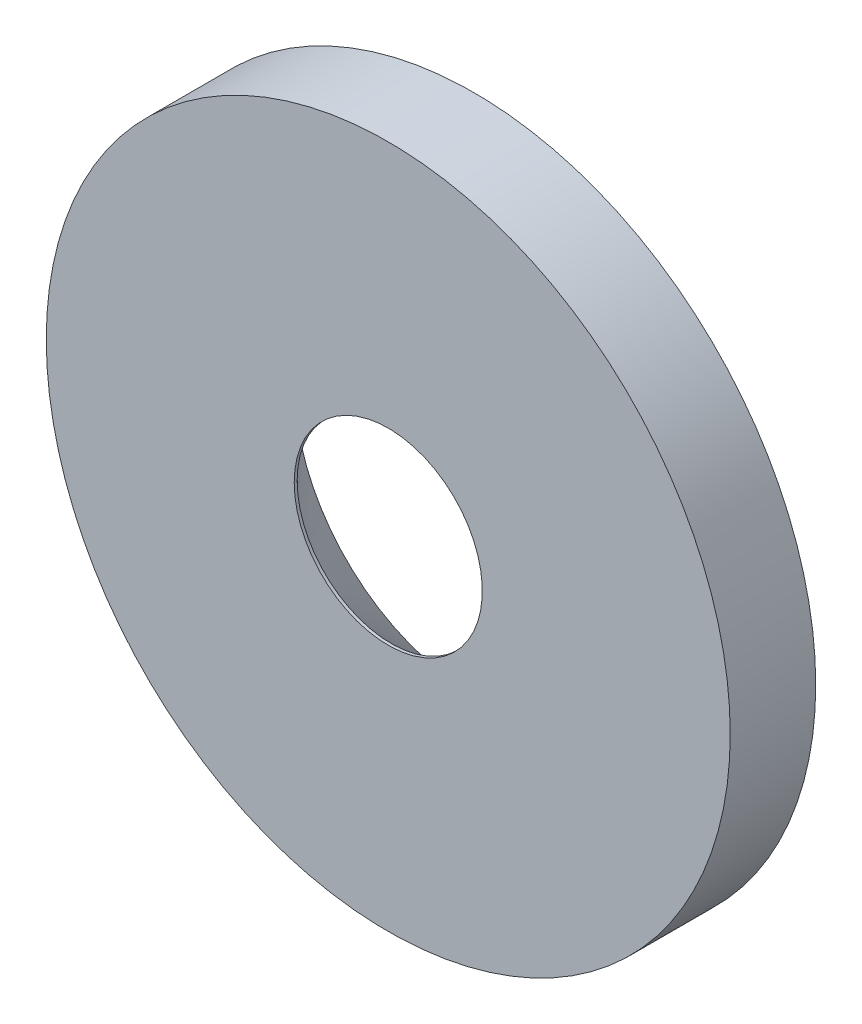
ISO-10303-21;
HEADER;
FILE_DESCRIPTION(('STEP AP214'),'2;1');
FILE_NAME('part.step','',(''),(''),'','','');
FILE_SCHEMA(('AUTOMOTIVE_DESIGN { 1 0 10303 214 1 1 1 1 }'));
ENDSEC;
DATA;
#1=APPLICATION_CONTEXT('core data for automotive mechanical design processes');
#2=APPLICATION_PROTOCOL_DEFINITION('international standard','automotive_design',2000,#1);
#3=PRODUCT_CONTEXT('',#1,'mechanical');
#4=PRODUCT('Part','Part','',(#3));
#5=PRODUCT_RELATED_PRODUCT_CATEGORY('part','',(#4));
#6=PRODUCT_DEFINITION_FORMATION('','',#4);
#7=PRODUCT_DEFINITION_CONTEXT('part definition',#1,'design');
#8=PRODUCT_DEFINITION('design','',#6,#7);
#9=PRODUCT_DEFINITION_SHAPE('','',#8);
#10=(LENGTH_UNIT() NAMED_UNIT(*) SI_UNIT(.MILLI.,.METRE.));
#11=(NAMED_UNIT(*) PLANE_ANGLE_UNIT() SI_UNIT($,.RADIAN.));
#12=(NAMED_UNIT(*) SI_UNIT($,.STERADIAN.) SOLID_ANGLE_UNIT());
#13=UNCERTAINTY_MEASURE_WITH_UNIT(LENGTH_MEASURE(1.E-05),#10,'distance_accuracy_value','');
#14=(GEOMETRIC_REPRESENTATION_CONTEXT(3) GLOBAL_UNCERTAINTY_ASSIGNED_CONTEXT((#13)) GLOBAL_UNIT_ASSIGNED_CONTEXT((#10,
#11,#12)) REPRESENTATION_CONTEXT('',''));
#15=CARTESIAN_POINT('',(0.,0.,0.));
#16=DIRECTION('',(0.,0.,1.));
#17=DIRECTION('',(1.,0.,0.));
#18=AXIS2_PLACEMENT_3D('',#15,#16,#17);
#19=CARTESIAN_POINT('',(0.,0.,3.));
#20=DIRECTION('',(0.,0.,1.));
#21=DIRECTION('',(1.,0.,0.));
#22=AXIS2_PLACEMENT_3D('',#19,#20,#21);
#23=PLANE('',#22);
#24=CARTESIAN_POINT('',(0.,0.,3.));
#25=DIRECTION('',(0.,0.,1.));
#26=DIRECTION('',(1.,0.,0.));
#27=AXIS2_PLACEMENT_3D('',#24,#25,#26);
#28=CIRCLE('',#27,12.);
#29=CARTESIAN_POINT('',(12.,0.,3.));
#30=VERTEX_POINT('',#29);
#31=EDGE_CURVE('E10',#30,#30,#28,.T.);
#32=ORIENTED_EDGE('',*,*,#31,.T.);
#33=EDGE_LOOP('',(#32));
#34=FACE_BOUND('',#33,.T.);
#35=CARTESIAN_POINT('',(0.,0.,3.));
#36=DIRECTION('',(0.,0.,-1.));
#37=DIRECTION('',(-1.,0.,0.));
#38=AXIS2_PLACEMENT_3D('',#35,#36,#37);
#39=CIRCLE('',#38,3.3);
#40=CARTESIAN_POINT('',(-3.3,0.,3.));
#41=VERTEX_POINT('',#40);
#42=EDGE_CURVE('E368',#41,#41,#39,.T.);
#43=ORIENTED_EDGE('',*,*,#42,.T.);
#44=EDGE_LOOP('',(#43));
#45=FACE_BOUND('',#44,.T.);
#46=ADVANCED_FACE('F348',(#34,#45),#23,.T.);
#47=CARTESIAN_POINT('',(0.,0.,3.));
#48=DIRECTION('',(0.,0.,-1.));
#49=DIRECTION('',(-1.,0.,0.));
#50=AXIS2_PLACEMENT_3D('',#47,#48,#49);
#51=CYLINDRICAL_SURFACE('',#50,12.);
#52=ORIENTED_EDGE('',*,*,#31,.F.);
#53=EDGE_LOOP('',(#52));
#54=FACE_BOUND('',#53,.T.);
#55=CARTESIAN_POINT('',(0.,0.,0.));
#56=DIRECTION('',(0.,0.,1.));
#57=DIRECTION('',(1.,0.,0.));
#58=AXIS2_PLACEMENT_3D('',#55,#56,#57);
#59=CIRCLE('',#58,12.);
#60=CARTESIAN_POINT('',(12.,0.,0.));
#61=VERTEX_POINT('',#60);
#62=EDGE_CURVE('E355',#61,#61,#59,.T.);
#63=ORIENTED_EDGE('',*,*,#62,.T.);
#64=EDGE_LOOP('',(#63));
#65=FACE_BOUND('',#64,.T.);
#66=ADVANCED_FACE('F350',(#54,#65),#51,.T.);
#67=CARTESIAN_POINT('',(0.,0.,0.));
#68=DIRECTION('',(0.,0.,1.));
#69=DIRECTION('',(1.,0.,0.));
#70=AXIS2_PLACEMENT_3D('',#67,#68,#69);
#71=PLANE('',#70);
#72=CARTESIAN_POINT('',(0.,0.,0.));
#73=DIRECTION('',(0.,0.,-1.));
#74=DIRECTION('',(-1.,0.,0.));
#75=AXIS2_PLACEMENT_3D('',#72,#73,#74);
#76=CIRCLE('',#75,6.3);
#77=CARTESIAN_POINT('',(-6.3,0.,0.));
#78=VERTEX_POINT('',#77);
#79=EDGE_CURVE('E359',#78,#78,#76,.T.);
#80=ORIENTED_EDGE('',*,*,#79,.F.);
#81=EDGE_LOOP('',(#80));
#82=FACE_BOUND('',#81,.T.);
#83=ORIENTED_EDGE('',*,*,#62,.F.);
#84=EDGE_LOOP('',(#83));
#85=FACE_BOUND('',#84,.T.);
#86=ADVANCED_FACE('F382',(#82,#85),#71,.F.);
#87=CARTESIAN_POINT('',(0.,0.,0.));
#88=DIRECTION('',(0.,0.,-1.));
#89=DIRECTION('',(-1.,0.,0.));
#90=AXIS2_PLACEMENT_3D('',#87,#88,#89);
#91=CONICAL_SURFACE('',#90,6.3,0.802851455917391);
#92=CARTESIAN_POINT('',(0.,0.,2.89706632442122));
#93=DIRECTION('',(0.,0.,-1.));
#94=DIRECTION('',(-1.,0.,0.));
#95=AXIS2_PLACEMENT_3D('',#92,#93,#94);
#96=CIRCLE('',#95,3.3);
#97=CARTESIAN_POINT('',(-3.3,0.,2.89706632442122));
#98=VERTEX_POINT('',#97);
#99=EDGE_CURVE('E363',#98,#98,#96,.T.);
#100=ORIENTED_EDGE('',*,*,#99,.F.);
#101=EDGE_LOOP('',(#100));
#102=FACE_BOUND('',#101,.T.);
#103=ORIENTED_EDGE('',*,*,#79,.T.);
#104=EDGE_LOOP('',(#103));
#105=FACE_BOUND('',#104,.T.);
#106=ADVANCED_FACE('F376',(#102,#105),#91,.F.);
#107=CARTESIAN_POINT('',(0.,0.,0.));
#108=DIRECTION('',(0.,0.,-1.));
#109=DIRECTION('',(-1.,0.,0.));
#110=AXIS2_PLACEMENT_3D('',#107,#108,#109);
#111=CYLINDRICAL_SURFACE('',#110,3.3);
#112=ORIENTED_EDGE('',*,*,#42,.F.);
#113=EDGE_LOOP('',(#112));
#114=FACE_BOUND('',#113,.T.);
#115=ORIENTED_EDGE('',*,*,#99,.T.);
#116=EDGE_LOOP('',(#115));
#117=FACE_BOUND('',#116,.T.);
#118=ADVANCED_FACE('F373',(#114,#117),#111,.F.);
#119=CLOSED_SHELL('',(#46,#66,#86,#106,#118));
#120=MANIFOLD_SOLID_BREP('B2',#119);
#121=ADVANCED_BREP_SHAPE_REPRESENTATION('',(#18,#120),#14);
#122=SHAPE_DEFINITION_REPRESENTATION(#9,#121);
ENDSEC;
END-ISO-10303-21;
